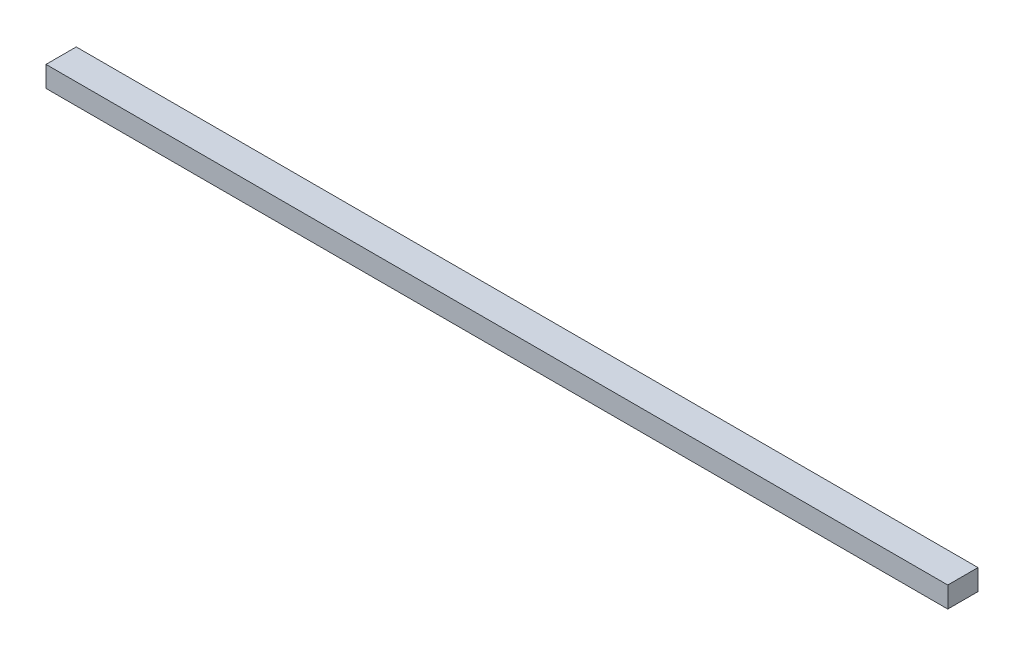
ISO-10303-21;
HEADER;
FILE_DESCRIPTION(('STEP AP214'),'2;1');
FILE_NAME('part.step','',(''),(''),'','','');
FILE_SCHEMA(('AUTOMOTIVE_DESIGN { 1 0 10303 214 1 1 1 1 }'));
ENDSEC;
DATA;
#1=APPLICATION_CONTEXT('core data for automotive mechanical design processes');
#2=APPLICATION_PROTOCOL_DEFINITION('international standard','automotive_design',2000,#1);
#3=PRODUCT_CONTEXT('',#1,'mechanical');
#4=PRODUCT('Part','Part','',(#3));
#5=PRODUCT_RELATED_PRODUCT_CATEGORY('part','',(#4));
#6=PRODUCT_DEFINITION_FORMATION('','',#4);
#7=PRODUCT_DEFINITION_CONTEXT('part definition',#1,'design');
#8=PRODUCT_DEFINITION('design','',#6,#7);
#9=PRODUCT_DEFINITION_SHAPE('','',#8);
#10=(LENGTH_UNIT() NAMED_UNIT(*) SI_UNIT(.MILLI.,.METRE.));
#11=(NAMED_UNIT(*) PLANE_ANGLE_UNIT() SI_UNIT($,.RADIAN.));
#12=(NAMED_UNIT(*) SI_UNIT($,.STERADIAN.) SOLID_ANGLE_UNIT());
#13=UNCERTAINTY_MEASURE_WITH_UNIT(LENGTH_MEASURE(1.E-05),#10,'distance_accuracy_value','');
#14=(GEOMETRIC_REPRESENTATION_CONTEXT(3) GLOBAL_UNCERTAINTY_ASSIGNED_CONTEXT((#13)) GLOBAL_UNIT_ASSIGNED_CONTEXT((#10,
#11,#12)) REPRESENTATION_CONTEXT('',''));
#15=CARTESIAN_POINT('',(0.,0.,0.));
#16=DIRECTION('',(0.,0.,1.));
#17=DIRECTION('',(1.,0.,0.));
#18=AXIS2_PLACEMENT_3D('',#15,#16,#17);
#19=CARTESIAN_POINT('',(274.6375,12.7,9.2075));
#20=DIRECTION('',(-1.,0.,0.));
#21=DIRECTION('',(0.,0.,1.));
#22=AXIS2_PLACEMENT_3D('',#19,#20,#21);
#23=PLANE('',#22);
#24=DIRECTION('',(0.,0.,-1.));
#25=VECTOR('',#24,1.);
#26=CARTESIAN_POINT('',(274.6375,0.,9.2075));
#27=LINE('',#26,#25);
#28=CARTESIAN_POINT('',(274.6375,0.,9.2075));
#29=VERTEX_POINT('',#28);
#30=CARTESIAN_POINT('',(274.6375,0.,-9.2075));
#31=VERTEX_POINT('',#30);
#32=EDGE_CURVE('E96',#29,#31,#27,.T.);
#33=ORIENTED_EDGE('',*,*,#32,.T.);
#34=DIRECTION('',(0.,-1.,0.));
#35=VECTOR('',#34,1.);
#36=CARTESIAN_POINT('',(274.6375,12.7,-9.2075));
#37=LINE('',#36,#35);
#38=CARTESIAN_POINT('',(274.6375,12.7,-9.2075));
#39=VERTEX_POINT('',#38);
#40=EDGE_CURVE('E11',#39,#31,#37,.T.);
#41=ORIENTED_EDGE('',*,*,#40,.F.);
#42=DIRECTION('',(0.,0.,-1.));
#43=VECTOR('',#42,1.);
#44=CARTESIAN_POINT('',(274.6375,12.7,9.2075));
#45=LINE('',#44,#43);
#46=CARTESIAN_POINT('',(274.6375,12.7,9.2075));
#47=VERTEX_POINT('',#46);
#48=EDGE_CURVE('E84',#47,#39,#45,.T.);
#49=ORIENTED_EDGE('',*,*,#48,.F.);
#50=DIRECTION('',(0.,-1.,0.));
#51=VECTOR('',#50,1.);
#52=CARTESIAN_POINT('',(274.6375,12.7,9.2075));
#53=LINE('',#52,#51);
#54=EDGE_CURVE('E92',#47,#29,#53,.T.);
#55=ORIENTED_EDGE('',*,*,#54,.T.);
#56=EDGE_LOOP('',(#33,#41,#49,#55));
#57=FACE_BOUND('',#56,.T.);
#58=ADVANCED_FACE('F33',(#57),#23,.F.);
#59=CARTESIAN_POINT('',(-274.6375,12.7,-9.2075));
#60=DIRECTION('',(0.,0.,1.));
#61=DIRECTION('',(1.,0.,0.));
#62=AXIS2_PLACEMENT_3D('',#59,#60,#61);
#63=PLANE('',#62);
#64=DIRECTION('',(-1.,0.,0.));
#65=VECTOR('',#64,1.);
#66=CARTESIAN_POINT('',(-274.6375,0.,-9.2075));
#67=LINE('',#66,#65);
#68=CARTESIAN_POINT('',(-274.6375,0.,-9.2075));
#69=VERTEX_POINT('',#68);
#70=EDGE_CURVE('E88',#31,#69,#67,.T.);
#71=ORIENTED_EDGE('',*,*,#70,.T.);
#72=DIRECTION('',(0.,-1.,0.));
#73=VECTOR('',#72,1.);
#74=CARTESIAN_POINT('',(-274.6375,12.7,-9.2075));
#75=LINE('',#74,#73);
#76=CARTESIAN_POINT('',(-274.6375,12.7,-9.2075));
#77=VERTEX_POINT('',#76);
#78=EDGE_CURVE('E41',#77,#69,#75,.T.);
#79=ORIENTED_EDGE('',*,*,#78,.F.);
#80=DIRECTION('',(-1.,0.,0.));
#81=VECTOR('',#80,1.);
#82=CARTESIAN_POINT('',(-274.6375,12.7,-9.2075));
#83=LINE('',#82,#81);
#84=EDGE_CURVE('E79',#39,#77,#83,.T.);
#85=ORIENTED_EDGE('',*,*,#84,.F.);
#86=ORIENTED_EDGE('',*,*,#40,.T.);
#87=EDGE_LOOP('',(#71,#79,#85,#86));
#88=FACE_BOUND('',#87,.T.);
#89=ADVANCED_FACE('F87',(#88),#63,.F.);
#90=CARTESIAN_POINT('',(-274.6375,12.7,9.2075));
#91=DIRECTION('',(1.,0.,0.));
#92=DIRECTION('',(0.,0.,-1.));
#93=AXIS2_PLACEMENT_3D('',#90,#91,#92);
#94=PLANE('',#93);
#95=DIRECTION('',(0.,0.,1.));
#96=VECTOR('',#95,1.);
#97=CARTESIAN_POINT('',(-274.6375,0.,9.2075));
#98=LINE('',#97,#96);
#99=CARTESIAN_POINT('',(-274.6375,0.,9.2075));
#100=VERTEX_POINT('',#99);
#101=EDGE_CURVE('E66',#69,#100,#98,.T.);
#102=ORIENTED_EDGE('',*,*,#101,.T.);
#103=DIRECTION('',(0.,-1.,0.));
#104=VECTOR('',#103,1.);
#105=CARTESIAN_POINT('',(-274.6375,12.7,9.2075));
#106=LINE('',#105,#104);
#107=CARTESIAN_POINT('',(-274.6375,12.7,9.2075));
#108=VERTEX_POINT('',#107);
#109=EDGE_CURVE('E89',#108,#100,#106,.T.);
#110=ORIENTED_EDGE('',*,*,#109,.F.);
#111=DIRECTION('',(0.,0.,1.));
#112=VECTOR('',#111,1.);
#113=CARTESIAN_POINT('',(-274.6375,12.7,9.2075));
#114=LINE('',#113,#112);
#115=EDGE_CURVE('E82',#77,#108,#114,.T.);
#116=ORIENTED_EDGE('',*,*,#115,.F.);
#117=ORIENTED_EDGE('',*,*,#78,.T.);
#118=EDGE_LOOP('',(#102,#110,#116,#117));
#119=FACE_BOUND('',#118,.T.);
#120=ADVANCED_FACE('F90',(#119),#94,.F.);
#121=CARTESIAN_POINT('',(-274.6375,12.7,9.2075));
#122=DIRECTION('',(0.,0.,-1.));
#123=DIRECTION('',(-1.,0.,0.));
#124=AXIS2_PLACEMENT_3D('',#121,#122,#123);
#125=PLANE('',#124);
#126=DIRECTION('',(1.,0.,0.));
#127=VECTOR('',#126,1.);
#128=CARTESIAN_POINT('',(-274.6375,0.,9.2075));
#129=LINE('',#128,#127);
#130=EDGE_CURVE('E72',#100,#29,#129,.T.);
#131=ORIENTED_EDGE('',*,*,#130,.T.);
#132=ORIENTED_EDGE('',*,*,#54,.F.);
#133=DIRECTION('',(1.,0.,0.));
#134=VECTOR('',#133,1.);
#135=CARTESIAN_POINT('',(-274.6375,12.7,9.2075));
#136=LINE('',#135,#134);
#137=EDGE_CURVE('E49',#108,#47,#136,.T.);
#138=ORIENTED_EDGE('',*,*,#137,.F.);
#139=ORIENTED_EDGE('',*,*,#109,.T.);
#140=EDGE_LOOP('',(#131,#132,#138,#139));
#141=FACE_BOUND('',#140,.T.);
#142=ADVANCED_FACE('F103',(#141),#125,.F.);
#143=CARTESIAN_POINT('',(0.,12.7,0.));
#144=DIRECTION('',(0.,-1.,0.));
#145=DIRECTION('',(0.,0.,-1.));
#146=AXIS2_PLACEMENT_3D('',#143,#144,#145);
#147=PLANE('',#146);
#148=ORIENTED_EDGE('',*,*,#48,.T.);
#149=ORIENTED_EDGE('',*,*,#84,.T.);
#150=ORIENTED_EDGE('',*,*,#115,.T.);
#151=ORIENTED_EDGE('',*,*,#137,.T.);
#152=EDGE_LOOP('',(#148,#149,#150,#151));
#153=FACE_BOUND('',#152,.T.);
#154=ADVANCED_FACE('F80',(#153),#147,.F.);
#155=CARTESIAN_POINT('',(0.,0.,0.));
#156=DIRECTION('',(0.,-1.,0.));
#157=DIRECTION('',(0.,0.,-1.));
#158=AXIS2_PLACEMENT_3D('',#155,#156,#157);
#159=PLANE('',#158);
#160=ORIENTED_EDGE('',*,*,#32,.F.);
#161=ORIENTED_EDGE('',*,*,#130,.F.);
#162=ORIENTED_EDGE('',*,*,#101,.F.);
#163=ORIENTED_EDGE('',*,*,#70,.F.);
#164=EDGE_LOOP('',(#160,#161,#162,#163));
#165=FACE_BOUND('',#164,.T.);
#166=ADVANCED_FACE('F106',(#165),#159,.T.);
#167=CLOSED_SHELL('',(#58,#89,#120,#142,#154,#166));
#168=MANIFOLD_SOLID_BREP('B2',#167);
#169=ADVANCED_BREP_SHAPE_REPRESENTATION('',(#18,#168),#14);
#170=SHAPE_DEFINITION_REPRESENTATION(#9,#169);
ENDSEC;
END-ISO-10303-21;
